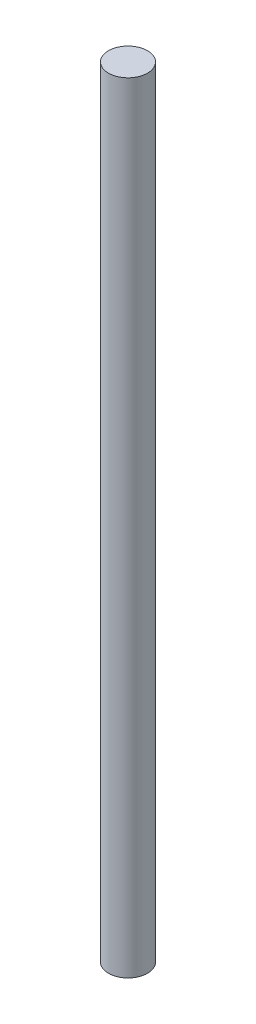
ISO-10303-21;
HEADER;
FILE_DESCRIPTION(('STEP AP214'),'2;1');
FILE_NAME('part.step','',(''),(''),'','','');
FILE_SCHEMA(('AUTOMOTIVE_DESIGN { 1 0 10303 214 1 1 1 1 }'));
ENDSEC;
DATA;
#1=APPLICATION_CONTEXT('core data for automotive mechanical design processes');
#2=APPLICATION_PROTOCOL_DEFINITION('international standard','automotive_design',2000,#1);
#3=PRODUCT_CONTEXT('',#1,'mechanical');
#4=PRODUCT('Part','Part','',(#3));
#5=PRODUCT_RELATED_PRODUCT_CATEGORY('part','',(#4));
#6=PRODUCT_DEFINITION_FORMATION('','',#4);
#7=PRODUCT_DEFINITION_CONTEXT('part definition',#1,'design');
#8=PRODUCT_DEFINITION('design','',#6,#7);
#9=PRODUCT_DEFINITION_SHAPE('','',#8);
#10=(LENGTH_UNIT() NAMED_UNIT(*) SI_UNIT(.MILLI.,.METRE.));
#11=(NAMED_UNIT(*) PLANE_ANGLE_UNIT() SI_UNIT($,.RADIAN.));
#12=(NAMED_UNIT(*) SI_UNIT($,.STERADIAN.) SOLID_ANGLE_UNIT());
#13=UNCERTAINTY_MEASURE_WITH_UNIT(LENGTH_MEASURE(1.E-05),#10,'distance_accuracy_value','');
#14=(GEOMETRIC_REPRESENTATION_CONTEXT(3) GLOBAL_UNCERTAINTY_ASSIGNED_CONTEXT((#13)) GLOBAL_UNIT_ASSIGNED_CONTEXT((#10,
#11,#12)) REPRESENTATION_CONTEXT('',''));
#15=CARTESIAN_POINT('',(0.,0.,0.));
#16=DIRECTION('',(0.,0.,1.));
#17=DIRECTION('',(1.,0.,0.));
#18=AXIS2_PLACEMENT_3D('',#15,#16,#17);
#19=CARTESIAN_POINT('',(0.,-100.,0.));
#20=DIRECTION('',(0.,1.,0.));
#21=DIRECTION('',(0.,0.,1.));
#22=AXIS2_PLACEMENT_3D('',#19,#20,#21);
#23=CYLINDRICAL_SURFACE('',#22,2.5);
#24=CARTESIAN_POINT('',(0.,-100.,0.));
#25=DIRECTION('',(0.,1.,0.));
#26=DIRECTION('',(0.,0.,1.));
#27=AXIS2_PLACEMENT_3D('',#24,#25,#26);
#28=CIRCLE('',#27,2.5);
#29=CARTESIAN_POINT('',(0.,-100.,2.5));
#30=VERTEX_POINT('',#29);
#31=EDGE_CURVE('E10',#30,#30,#28,.T.);
#32=ORIENTED_EDGE('',*,*,#31,.T.);
#33=EDGE_LOOP('',(#32));
#34=FACE_BOUND('',#33,.T.);
#35=CARTESIAN_POINT('',(0.,0.,0.));
#36=DIRECTION('',(0.,1.,0.));
#37=DIRECTION('',(0.,0.,1.));
#38=AXIS2_PLACEMENT_3D('',#35,#36,#37);
#39=CIRCLE('',#38,2.5);
#40=CARTESIAN_POINT('',(0.,0.,2.5));
#41=VERTEX_POINT('',#40);
#42=EDGE_CURVE('E32',#41,#41,#39,.T.);
#43=ORIENTED_EDGE('',*,*,#42,.F.);
#44=EDGE_LOOP('',(#43));
#45=FACE_BOUND('',#44,.T.);
#46=ADVANCED_FACE('F26',(#34,#45),#23,.T.);
#47=CARTESIAN_POINT('',(0.,-100.,0.));
#48=DIRECTION('',(0.,1.,0.));
#49=DIRECTION('',(0.,0.,1.));
#50=AXIS2_PLACEMENT_3D('',#47,#48,#49);
#51=PLANE('',#50);
#52=ORIENTED_EDGE('',*,*,#31,.F.);
#53=EDGE_LOOP('',(#52));
#54=FACE_BOUND('',#53,.T.);
#55=ADVANCED_FACE('F41',(#54),#51,.F.);
#56=CARTESIAN_POINT('',(0.,0.,0.));
#57=DIRECTION('',(0.,1.,0.));
#58=DIRECTION('',(0.,0.,1.));
#59=AXIS2_PLACEMENT_3D('',#56,#57,#58);
#60=PLANE('',#59);
#61=ORIENTED_EDGE('',*,*,#42,.T.);
#62=EDGE_LOOP('',(#61));
#63=FACE_BOUND('',#62,.T.);
#64=ADVANCED_FACE('F38',(#63),#60,.T.);
#65=CLOSED_SHELL('',(#46,#55,#64));
#66=MANIFOLD_SOLID_BREP('B2',#65);
#67=ADVANCED_BREP_SHAPE_REPRESENTATION('',(#18,#66),#14);
#68=SHAPE_DEFINITION_REPRESENTATION(#9,#67);
ENDSEC;
END-ISO-10303-21;
